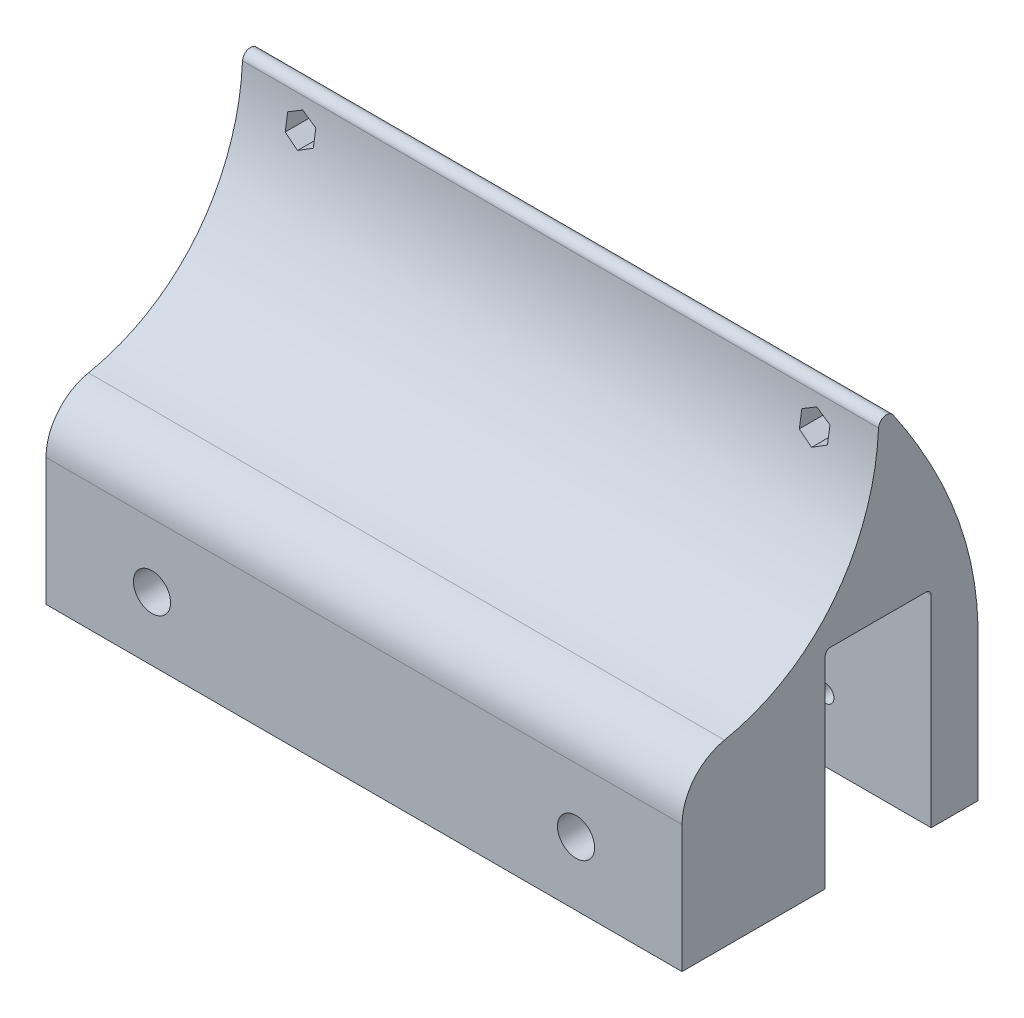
from build123d import *

# Parameters (mm, degrees)
CROQUIS1_W               = 160
CROQUIS1_H               = 160
CROQUIS1_R               = 2.15
SALIENTE_EXTRUIR1_DEPTH  = 180
CROQUIS3_W               = 48.25
CROQUIS3_H               = 125
CORTAR_EXTRUIR4_DEPTH    = 175
CORTAR_EXTRUIR7_DEPTH    = 96.5
CROQUIS2_R               = 4.1
CORTAR_EXTRUIR8_DEPTH    = 195
CROQUIS13_R              = 14.25
CORTAR_EXTRUIR25_DEPTH   = 20
CORTAR_EXTRUIR26_START   = -140
CROQUIS13_2_R            = 14.25
CORTAR_EXTRUIR26_DEPTH   = 20
CORTAR_EXTRUIR12_DEPTH   = 195
CROQUIS14_W              = 160
CROQUIS14_H              = 160
CROQUIS14_R              = 2.15
SALIENTE_EXTRUIR7_DEPTH  = 20
CORTAR_EXTRUIR28_DEPTH   = 22.75
CUT_EXTRUDE1_DEPTH       = 22.75
CROQUIS16_R              = 1.5
CROQUIS16_R_2            = 10
CORTAR_EXTRUIR29_DEPTH   = 20
CROQUIS17_R              = 11.25
CORTAR_EXTRUIR30_DEPTH   = 2
SALIENTE_EXTRUIR6_START  = 11
CROQUIS1_17_R            = 3.7
CROQUIS1_17_R_2          = 2.15
SALIENTE_EXTRUIR6_DEPTH  = 11
CROQUIS22_R              = 3.5
CORTAR_EXTRUIR32_DEPTH   = 5
CORTAR_EXTRUIR33_START   = 35
CROQUIS22_2_R            = 3.5
CORTAR_EXTRUIR33_DEPTH   = 35
CROQUIS24_R              = 32.5
CORTAR_EXTRUIR35_DEPTH   = 8
CROQUIS25_R              = 2.1
CORTAR_EXTRUIR36_DEPTH   = 15
CROQUIS28_R              = 1.65
CORTAR_EXTRUIR38_DEPTH   = 24
REDONDEO14_R             = 1.5
FILLET1_R                = 2
FILLET2_R                = 10
SKETCH4_W                = 185.928865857
SKETCH4_H                = 249.389616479
CUT_EXTRUDE6_DEPTH       = 12.75
SKETCH7_W                = 189.312552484
SKETCH7_H                = 214.126716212
CUT_EXTRUDE8_DEPTH       = 31.75
SKETCH8_W                = 182.063470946
SKETCH8_H                = 221.933419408
CUT_EXTRUDE9_DEPTH       = 19
SKETCH9_W                = 15
SKETCH9_H                = 25
CUT_EXTRUDE10_DEPTH      = 96.5
BOSS_EXTRUDE2_DEPTH      = 23.5
CUT_EXTRUDE11_DEPTH      = 170.770502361
CUT_EXTRUDE11_DEPTH_BACK = 170.770502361
SKETCH11_R               = 1.6
CUT_EXTRUDE12_DEPTH      = 170.770502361
CUT_EXTRUDE12_DEPTH_BACK = 170.770502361
SKETCH13_R               = 3.5
CUT_EXTRUDE13_DEPTH      = 25
CUT_EXTRUDE14_DEPTH      = 170.770502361
CUT_EXTRUDE14_DEPTH_BACK = 170.770502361
SKETCH14_R               = 1.65
CUT_EXTRUDE15_DEPTH      = 5
SKETCH18_W               = 120
SKETCH18_H               = 20
CUT_EXTRUDE20_DEPTH      = 39
FILLET3_R                = 1


with BuildPart() as part:
    # Croquis1 → Saliente-Extruir1 (new body)
    with BuildSketch(Plane(origin=(0, 0, 0), x_dir=(1, 0, 0), z_dir=(0, 1, 0))):
        with Locations((80, 80)):
            Rectangle(CROQUIS1_W, CROQUIS1_H)
        with Locations(Location((50.000942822, 141, 0), (0, 0, 90))):
            Circle(CROQUIS1_R, mode=Mode.SUBTRACT)
        with Locations(Location((80, 148, 0), (0, 0, 90))):
            Circle(CROQUIS1_R, mode=Mode.SUBTRACT)
        with Locations(Location((110.000942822, 141, 0), (0, 0, 90))):
            Circle(CROQUIS1_R, mode=Mode.SUBTRACT)
    extrude(amount=SALIENTE_EXTRUIR1_DEPTH)

    # Croquis3 → Cortar-Extruir4 (cut)
    with BuildSketch(Plane.XY):
        with Locations((55.875, 117.5)):
            Rectangle(CROQUIS3_W, CROQUIS3_H)
        with Locations((104.125, 117.5)):
            Rectangle(CROQUIS3_W, CROQUIS3_H)
    extrude(amount=-CORTAR_EXTRUIR4_DEPTH, mode=Mode.SUBTRACT)

    # Croquis9 → Cortar-Extruir7 (cut)
    with BuildSketch(Plane.ZY.offset(-128.25)):
        with BuildLine():
            Line((-104.186701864, 5), (-55.813298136, 5))
            add(Edge.make_bspline(
                [(-37.04411276, 55), (-47.540105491, 40.459989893), (-56.551643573, 23.655349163), (-55.813298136, 5)],
                knots=[0, 0, 0, 0, 1, 1, 1, 1], degree=3))
            Line((-37.04411276, 55), (-122.95588724, 55))
            add(Edge.make_bspline(
                [(-122.95588724, 55), (-112.459894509, 40.459989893), (-103.448356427, 23.655349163), (-104.186701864, 5)],
                knots=[0, 0, 0, 0, 1, 1, 1, 1], degree=3))
        make_face()
    extrude(amount=CORTAR_EXTRUIR7_DEPTH, mode=Mode.SUBTRACT)

    # Croquis2 → Cortar-Extruir8 (cut)
    with BuildSketch(Plane.ZY):
        with BuildLine():
            ThreePointArc((-137.424115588, 102.608308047), (-128.184548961, 155.752611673), (-80, 180))
            Line((-80, 180), (-160, 180))
            Line((-160, 180), (-160, 13))
            add(Edge.make_bspline(
                [(-136.784020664, 100.62024259), (-132.696239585, 88.557792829), (-111.700127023, 48.156900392), (-135.607039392, 13.258894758), (-160, 13)],
                knots=[0.024750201, 0.024750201, 0.024750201, 0.024750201, 0.462172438, 1, 1, 1, 1], degree=3))
            ThreePointArc((-136.784020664, 100.62024259), (-137.112719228, 101.611489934), (-137.424115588, 102.608308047))
        make_face()
        with BuildLine():
            ThreePointArc((-20, 120), (-20.647464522, 111.20929284), (-22.575884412, 102.608308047))
            ThreePointArc((-22.575884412, 102.608308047), (-22.887280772, 101.611489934), (-23.215979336, 100.62024259))
            add(Edge.make_bspline(
                [(-23.215979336, 100.62024259), (-27.303760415, 88.557792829), (-48.299872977, 48.156900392), (-24.392960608, 13.258894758), (0, 13)],
                knots=[0.024750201, 0.024750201, 0.024750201, 0.024750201, 0.462172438, 1, 1, 1, 1], degree=3))
            Line((0, 13), (0, 180))
            Line((0, 180), (-80, 180))
            ThreePointArc((-80, 180), (-37.573593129, 162.426406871), (-20, 120))
        make_face()
        with Locations((-80, 120)):
            Circle(CROQUIS2_R)
    extrude(amount=-CORTAR_EXTRUIR8_DEPTH, mode=Mode.SUBTRACT)

    # Croquis13 → Cortar-Extruir25 (cut)
    with BuildSketch(Plane(origin=(160, 0, 0), x_dir=(0, 0, -1), z_dir=(1, 0, 0))):
        with Locations((80, 120)):
            Circle(CROQUIS13_R)
    extrude(amount=-CORTAR_EXTRUIR25_DEPTH, mode=Mode.SUBTRACT)

    # Croquis13_2 → Cortar-Extruir26 (cut)
    with BuildSketch(Plane(origin=(160, 0, 0), x_dir=(0, 0, -1), z_dir=(1, 0, 0)).offset(CORTAR_EXTRUIR26_START)):
        with Locations((80, 120)):
            Circle(CROQUIS13_2_R)
    extrude(amount=-CORTAR_EXTRUIR26_DEPTH, mode=Mode.SUBTRACT)

    # Croquis10 → Cortar-Extruir12 (cut)
    with BuildSketch(Plane(origin=(0, 5, 0), x_dir=(1, 0, 0), z_dir=(0, 1, 0))):
        with BuildLine():
            Line((46.75, 104.186701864), (113.25, 104.186701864))
            ThreePointArc((113.25, 104.186701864), (123.856601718, 99.793303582), (128.25, 89.186701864))
            Line((128.25, 89.186701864), (128.25, 70.813298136))
            ThreePointArc((128.25, 70.813298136), (123.856601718, 60.206696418), (113.25, 55.813298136))
            Line((113.25, 55.813298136), (46.75, 55.813298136))
            ThreePointArc((46.75, 55.813298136), (36.143398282, 60.206696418), (31.75, 70.813298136))
            Line((31.75, 70.813298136), (31.75, 89.186701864))
            ThreePointArc((31.75, 89.186701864), (36.143398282, 99.793303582), (46.75, 104.186701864))
        make_face()
    extrude(amount=-CORTAR_EXTRUIR12_DEPTH, mode=Mode.SUBTRACT)

    # Croquis14 → Saliente-Extruir7 (add)
    with BuildSketch(Plane.XZ):
        with Locations((80, -80)):
            Rectangle(CROQUIS14_W, CROQUIS14_H)
        with Locations(Location((50.000942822, -141, 0), (0, 0, 270))):
            Circle(CROQUIS14_R, mode=Mode.SUBTRACT)
        with Locations(Location((80, -148, 0), (0, 0, 270))):
            Circle(CROQUIS14_R, mode=Mode.SUBTRACT)
        with Locations(Location((110.000942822, -141, 0), (0, 0, 270))):
            Circle(CROQUIS14_R, mode=Mode.SUBTRACT)
        with BuildLine():
            Line((113.25, -55.813298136), (46.75, -55.813298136))
            ThreePointArc((46.75, -55.813298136), (36.143398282, -60.206696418), (31.75, -70.813298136))
            Line((31.75, -70.813298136), (31.75, -89.186701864))
            ThreePointArc((31.75, -89.186701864), (36.143398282, -99.793303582), (46.75, -104.186701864))
            Line((46.75, -104.186701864), (113.25, -104.186701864))
            ThreePointArc((113.25, -104.186701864), (123.856601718, -99.793303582), (128.25, -89.186701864))
            Line((128.25, -89.186701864), (128.25, -70.813298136))
            ThreePointArc((128.25, -70.813298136), (123.856601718, -60.206696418), (113.25, -55.813298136))
        make_face(mode=Mode.SUBTRACT)
    extrude(amount=SALIENTE_EXTRUIR7_DEPTH)

    # Croquis15 → Cortar-Extruir28 (cut)
    with BuildSketch(Plane(origin=(160, 0, 0), x_dir=(0, 0, -1), z_dir=(1, 0, 0))):
        with BuildLine():
            Line((63, 33), (97, 33))
            ThreePointArc((97, 33), (100.535533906, 31.535533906), (102, 28))
            Line((102, 28), (102, -6))
            ThreePointArc((102, -6), (100.535533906, -9.535533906), (97, -11))
            Line((97, -11), (63, -11))
            ThreePointArc((63, -11), (59.464466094, -9.535533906), (58, -6))
            Line((58, -6), (58, 28))
            ThreePointArc((58, 28), (59.464466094, 31.535533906), (63, 33))
        make_face()
    cortar_extruir28 = extrude(amount=-CORTAR_EXTRUIR28_DEPTH, mode=Mode.SUBTRACT)

    # Sketch1 → Cut-Extrude1 (cut)
    with BuildSketch(Plane(origin=(160, 0, 0), x_dir=(0, 0, -1), z_dir=(1, 0, 0))):
        Polygon((52.940523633, 33), (102, 33), (102, 28), (102, -11), (63, -11), (52.940523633, -11), align=None)
    cut_extrude1 = extrude(amount=-CUT_EXTRUDE1_DEPTH, mode=Mode.SUBTRACT)

    # Croquis16 → Cortar-Extruir29 (cut)
    with BuildSketch(Plane(origin=(137.25, 0, 0), x_dir=(0, 0, -1), z_dir=(1, 0, 0))):
        with Locations((64.5, 26.5)):
            Circle(CROQUIS16_R)
        with Locations((64.5, -4.5)):
            Circle(CROQUIS16_R)
        with Locations((95.5, -4.5)):
            Circle(CROQUIS16_R)
        with Locations((95.5, 26.5)):
            Circle(CROQUIS16_R)
        with Locations((80, 11)):
            Circle(CROQUIS16_R_2)
    cortar_extruir29 = extrude(amount=-CORTAR_EXTRUIR29_DEPTH, mode=Mode.SUBTRACT)

    # Croquis17 → Cortar-Extruir30 (cut)
    with BuildSketch(Plane(origin=(137.25, 0, 0), x_dir=(0, 0, -1), z_dir=(1, 0, 0))):
        with Locations((80, 11)):
            Circle(CROQUIS17_R)
    cortar_extruir30 = extrude(amount=-CORTAR_EXTRUIR30_DEPTH, mode=Mode.SUBTRACT)

    # Croquis1_17 → Saliente-Extruir6 (add)
    # profile 1 of 6: a face of its own
    with BuildSketch(Plane(origin=(0, 0, 0), x_dir=(1, 0, 0), z_dir=(0, 1, 0)).offset(SALIENTE_EXTRUIR6_START)):
        with Locations((110.000942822, 141)):
            Circle(CROQUIS1_17_R)
        with Locations(Location((110.000942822, 141, 0), (0, 0, 90))):
            Circle(CROQUIS1_17_R_2, mode=Mode.SUBTRACT)
    # profile 2 of 6: a face of its own
    with BuildSketch(Plane(origin=(0, 0, 0), x_dir=(1, 0, 0), z_dir=(0, 1, 0)).offset(SALIENTE_EXTRUIR6_START)):
        with Locations((80, 148)):
            Circle(CROQUIS1_17_R)
        with Locations(Location((80, 148, 0), (0, 0, 90))):
            Circle(CROQUIS1_17_R_2, mode=Mode.SUBTRACT)
    # profile 3 of 6: a face of its own
    with BuildSketch(Plane(origin=(0, 0, 0), x_dir=(1, 0, 0), z_dir=(0, 1, 0)).offset(SALIENTE_EXTRUIR6_START)):
        with Locations((50.000942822, 141)):
            Circle(CROQUIS1_17_R)
        with Locations(Location((50.000942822, 141, 0), (0, 0, 90))):
            Circle(CROQUIS1_17_R_2, mode=Mode.SUBTRACT)
    # profile 4 of 6: a face of its own
    with BuildSketch(Plane(origin=(0, 0, 0), x_dir=(1, 0, 0), z_dir=(0, 1, 0)).offset(SALIENTE_EXTRUIR6_START)):
        with Locations((50.000942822, 19)):
            Circle(CROQUIS1_17_R)
        with Locations((50.000942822, 19)):
            Circle(CROQUIS1_17_R_2, mode=Mode.SUBTRACT)
    # profile 5 of 6: a face of its own
    with BuildSketch(Plane(origin=(0, 0, 0), x_dir=(1, 0, 0), z_dir=(0, 1, 0)).offset(SALIENTE_EXTRUIR6_START)):
        with Locations((80, 12)):
            Circle(CROQUIS1_17_R)
        with Locations((80, 12)):
            Circle(CROQUIS1_17_R_2, mode=Mode.SUBTRACT)
    # profile 6 of 6: a face of its own
    with BuildSketch(Plane(origin=(0, 0, 0), x_dir=(1, 0, 0), z_dir=(0, 1, 0)).offset(SALIENTE_EXTRUIR6_START)):
        with Locations((110.000942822, 19)):
            Circle(CROQUIS1_17_R)
        with Locations((110.000942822, 19)):
            Circle(CROQUIS1_17_R_2, mode=Mode.SUBTRACT)
    extrude(amount=-SALIENTE_EXTRUIR6_DEPTH)

    # Croquis22 → Cortar-Extruir32 (cut)
    with BuildSketch(Plane.ZY.offset(-128.25)):
        with Locations(Location((-95.5, 26.5, 0), (0, 0, 270))):
            Circle(CROQUIS22_R)
        with Locations(Location((-95.5, -4.5, 0), (0, 0, 270))):
            Circle(CROQUIS22_R)
        with Locations(Location((-64.5, -4.5, 0), (0, 0, 270))):
            Circle(CROQUIS22_R)
        with Locations(Location((-64.5, 26.5, 0), (0, 0, 270))):
            Circle(CROQUIS22_R)
    cortar_extruir32 = extrude(amount=-CORTAR_EXTRUIR32_DEPTH, mode=Mode.SUBTRACT)

    # Croquis22_2 → Cortar-Extruir33 (cut)
    with BuildSketch(Plane.ZY.offset(-128.25).offset(CORTAR_EXTRUIR33_START)):
        with Locations(Location((-95.5, 26.5, 0), (0, 0, 270))):
            Circle(CROQUIS22_2_R)
        with Locations(Location((-95.5, -4.5, 0), (0, 0, 270))):
            Circle(CROQUIS22_2_R)
        with Locations(Location((-64.5, -4.5, 0), (0, 0, 270))):
            Circle(CROQUIS22_2_R)
        with Locations(Location((-64.5, 26.5, 0), (0, 0, 270))):
            Circle(CROQUIS22_2_R)
    cortar_extruir33 = extrude(amount=-CORTAR_EXTRUIR33_DEPTH, mode=Mode.SUBTRACT)

    # Simetr_a1: Cortar-Extruir28, Cortar-Extruir29, Cortar-Extruir30, Cortar-Extruir32, Cortar-Extruir33 across plane
    add(cortar_extruir28.mirror(Plane(origin=(80, 0, 0), x_dir=(0, 0, 1), z_dir=(1, 0, 0))), mode=Mode.SUBTRACT)
    add(cortar_extruir29.mirror(Plane(origin=(80, 0, 0), x_dir=(0, 0, 1), z_dir=(1, 0, 0))), mode=Mode.SUBTRACT)
    add(cortar_extruir30.mirror(Plane(origin=(80, 0, 0), x_dir=(0, 0, 1), z_dir=(1, 0, 0))), mode=Mode.SUBTRACT)
    add(cortar_extruir32.mirror(Plane(origin=(80, 0, 0), x_dir=(0, 0, 1), z_dir=(1, 0, 0))), mode=Mode.SUBTRACT)
    add(cortar_extruir33.mirror(Plane(origin=(80, 0, 0), x_dir=(0, 0, 1), z_dir=(1, 0, 0))), mode=Mode.SUBTRACT)

    # Croquis24 → Cortar-Extruir35 (cut)
    with BuildSketch(Plane.ZY.offset(-160)):
        with Locations((-80, 120)):
            Circle(CROQUIS24_R)
    cortar_extruir35 = extrude(amount=CORTAR_EXTRUIR35_DEPTH, mode=Mode.SUBTRACT)

    # Croquis25 → Cortar-Extruir36 (cut)
    with BuildSketch(Plane(origin=(152, 0, 0), x_dir=(0, 0, -1), z_dir=(1, 0, 0))):
        with Locations((80, 97.5)):
            Circle(CROQUIS25_R)
        with Locations((99.485571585, 131.25)):
            Circle(CROQUIS25_R)
        with Locations(Location((60.514428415, 131.25, 0), (0, 0, 180))):
            Circle(CROQUIS25_R)
    cortar_extruir36 = extrude(amount=-CORTAR_EXTRUIR36_DEPTH, mode=Mode.SUBTRACT)

    # Simetr_a5: Cortar-Extruir35, Cortar-Extruir36 across plane
    add(cortar_extruir35.mirror(Plane(origin=(80, 0, 0), x_dir=(0, 0, 1), z_dir=(1, 0, 0))), mode=Mode.SUBTRACT)
    add(cortar_extruir36.mirror(Plane(origin=(80, 0, 0), x_dir=(0, 0, 1), z_dir=(1, 0, 0))), mode=Mode.SUBTRACT)

    # Croquis28 → Cortar-Extruir38 (cut)
    with BuildSketch(Plane.ZY.offset(-128.25)):
        with Locations(Location((-60.230270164, 18.33, 0), (0, 0, 270))):
            Circle(CROQUIS28_R)
    cortar_extruir38 = extrude(amount=-CORTAR_EXTRUIR38_DEPTH, mode=Mode.SUBTRACT)

    # Simetr_a6: Cortar-Extruir38 across plane
    add(cortar_extruir38.mirror(Plane(origin=(80, 0, 0), x_dir=(0, 0, 1), z_dir=(1, 0, 0))), mode=Mode.SUBTRACT)

    # Mirror1: Cut-Extrude1 across plane
    add(cut_extrude1.mirror(Plane(origin=(80, 0, 0), x_dir=(0, 0, 1), z_dir=(1, 0, 0))), mode=Mode.SUBTRACT)

    # Redondeo14
    redondeo14_edges = [part.edges().sort_by_distance(p)[0] for p in [
        (80, 55, -37.04411276),
        (80, 55, -122.95588724),
    ]]
    fillet(redondeo14_edges, radius=REDONDEO14_R)

    # Fillet1
    fillet1_edges = [part.edges().sort_by_distance(p)[0] for p in [
        (148.625, 33, -102),
        (148.625, -11, -102),
        (148.625, 33, -52.940523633),
        (148.625, -11, -52.940523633),
    ]]
    fillet(fillet1_edges, radius=FILLET1_R)

    # Fillet2
    fillet2_edges = [part.edges().sort_by_distance(p)[0] for p in [
        (80, 13, 0),
        (80, 13, -160),
    ]]
    fillet(fillet2_edges, radius=FILLET2_R)

    # Sketch4 → Cut-Extrude6 (cut)
    with BuildSketch(Plane(origin=(160, 0, 0), x_dir=(0, 0, -1), z_dir=(1, 0, 0))):
        with Locations((81.391683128, 70.119049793)):
            Rectangle(SKETCH4_W, SKETCH4_H)
    extrude(amount=-CUT_EXTRUDE6_DEPTH, mode=Mode.SUBTRACT)

    # Sketch7 → Cut-Extrude8 (cut)
    with BuildSketch(Plane.ZY):
        with Locations((-75.67843216, 80.139392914)):
            Rectangle(SKETCH7_W, SKETCH7_H)
    extrude(amount=-CUT_EXTRUDE8_DEPTH, mode=Mode.SUBTRACT)

    # Sketch8 → Cut-Extrude9 (cut)
    with BuildSketch(Plane(origin=(147.25, 0, 0), x_dir=(0, 0, -1), z_dir=(1, 0, 0))):
        with Locations((85.994432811, 78.745338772)):
            Rectangle(SKETCH8_W, SKETCH8_H)
    extrude(amount=-CUT_EXTRUDE9_DEPTH, mode=Mode.SUBTRACT)


with BuildPart() as cut_extrude9_kept_piece:
    # of the separate pieces the step leaves, the one the design keeps (cut_extrude9_pieces_kept)
    add(part.part.solids().sort_by_distance((128.25, 13.82502567, -8.010345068))[0])

    # Sketch9 → Cut-Extrude10 (cut)
    with BuildSketch(Plane(origin=(128.25, 0, 0), x_dir=(0, 0, -1), z_dir=(1, 0, 0))):
        with Locations((63.313298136, -7.5)):
            Rectangle(SKETCH9_W, SKETCH9_H)
    extrude(amount=-CUT_EXTRUDE10_DEPTH, mode=Mode.SUBTRACT)

    # Sketch10 → Boss-Extrude2 (add)
    with BuildSketch(Plane(origin=(128.25, 0, 0), x_dir=(0, 0, -1), z_dir=(1, 0, 0))):
        with BuildLine():
            Line((0, -20), (55.813298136, -20))
            Line((55.813298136, -20), (55.813298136, 5))
            add(Edge.make_bspline(
                [(55.813298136, 5), (56.485786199, 21.991368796), (49.070120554, 37.447456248), (39.811414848, 51.055514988)],
                knots=[0, 0, 0, 0, 0.910804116, 0.910804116, 0.910804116, 0.910804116], degree=3))
            ThreePointArc((39.811414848, 51.055514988), (38.160956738, 51.654520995), (37.072654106, 50.276690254))
            add(Edge.make_bspline(
                [(8.010345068, 13.82502567), (26.163450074, 17.510553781), (36.324048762, 33.008341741), (37.072654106, 50.276690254)],
                knots=[0.489267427, 0.489267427, 0.489267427, 0.489267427, 0.937794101, 0.937794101, 0.937794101, 0.937794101], degree=3))
            ThreePointArc((8.010345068, 13.82502567), (2.257372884, 10.353603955), (0, 4.024960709))
            Line((0, 4.024960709), (0, -20))
        make_face()
    extrude(amount=BOSS_EXTRUDE2_DEPTH)

    # Sketch11 → Cut-Extrude11 (cut, two sides: drawn at the far end of the back side and taken through both)
    with BuildSketch(Plane.XY.offset(-CUT_EXTRUDE11_DEPTH_BACK)):
        with Locations((43.25, 45)):
            Circle(SKETCH11_R)
        with Locations((140.25, 45)):
            Circle(SKETCH11_R)
    extrude(amount=CUT_EXTRUDE11_DEPTH + CUT_EXTRUDE11_DEPTH_BACK, mode=Mode.SUBTRACT)

    # Sketch12 → Cut-Extrude12 (cut, two sides: drawn at the far end of the back side and taken through both)
    with BuildSketch(Plane.XY.offset(-CUT_EXTRUDE12_DEPTH_BACK)):
        Polygon((45.9, 46.529978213), (43.25, 48.059956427), (40.6, 46.529978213), (40.6, 43.470021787), (43.25, 41.940043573), (45.9, 43.470021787), align=None)
        Polygon((142.9, 46.529978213), (140.25, 48.059956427), (137.6, 46.529978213), (137.6, 43.470021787), (140.25, 41.940043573), (142.9, 43.470021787), align=None)
    extrude(amount=CUT_EXTRUDE12_DEPTH + CUT_EXTRUDE12_DEPTH_BACK, mode=Mode.SUBTRACT)

    # Sketch13 → Cut-Extrude13 (cut)
    with BuildSketch(Plane.XY):
        with Locations((51.75, -7.987519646)):
            Circle(SKETCH13_R)
        with Locations((131.75, -7.987519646)):
            Circle(SKETCH13_R)
    extrude(amount=-CUT_EXTRUDE13_DEPTH, mode=Mode.SUBTRACT)

    # Sketch14 → Cut-Extrude14 (cut, two sides: drawn at the far end of the back side and taken through both)
    with BuildSketch(Plane.XY.offset(-CUT_EXTRUDE14_DEPTH_BACK)):
        with Locations((51.75, -7.987519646)):
            Circle(SKETCH14_R)
        with Locations((131.75, -7.987519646)):
            Circle(SKETCH14_R)
    extrude(amount=CUT_EXTRUDE14_DEPTH + CUT_EXTRUDE14_DEPTH_BACK, mode=Mode.SUBTRACT)

    # Sketch15 → Cut-Extrude15 (cut)
    with BuildSketch(Plane(origin=(0, 0, -55.813298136), x_dir=(-1, 0, 0), z_dir=(0, 0, -1))):
        Polygon((-129.05, -6.428673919), (-131.75, -4.869828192), (-134.45, -6.428673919), (-134.45, -9.546365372), (-131.75, -11.105211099), (-129.05, -9.546365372), align=None)
        Polygon((-49.05, -6.428673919), (-51.75, -4.869828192), (-54.45, -6.428673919), (-54.45, -9.546365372), (-51.75, -11.105211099), (-49.05, -9.546365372), align=None)
    extrude(amount=-CUT_EXTRUDE15_DEPTH, mode=Mode.SUBTRACT)

    # Sketch18 → Cut-Extrude20 (cut)
    with BuildSketch(Plane.XZ.offset(20)):
        with Locations((91.75, -37)):
            Rectangle(SKETCH18_W, SKETCH18_H)
    extrude(amount=-CUT_EXTRUDE20_DEPTH, mode=Mode.SUBTRACT)

    # Fillet3
    fillet3_edges = [cut_extrude9_kept_piece.edges().sort_by_distance(p)[0] for p in [
        (91.75, 19, -47),
        (91.75, 19, -27),
    ]]
    fillet(fillet3_edges, radius=FILLET3_R)


solid = cut_extrude9_kept_piece.part
